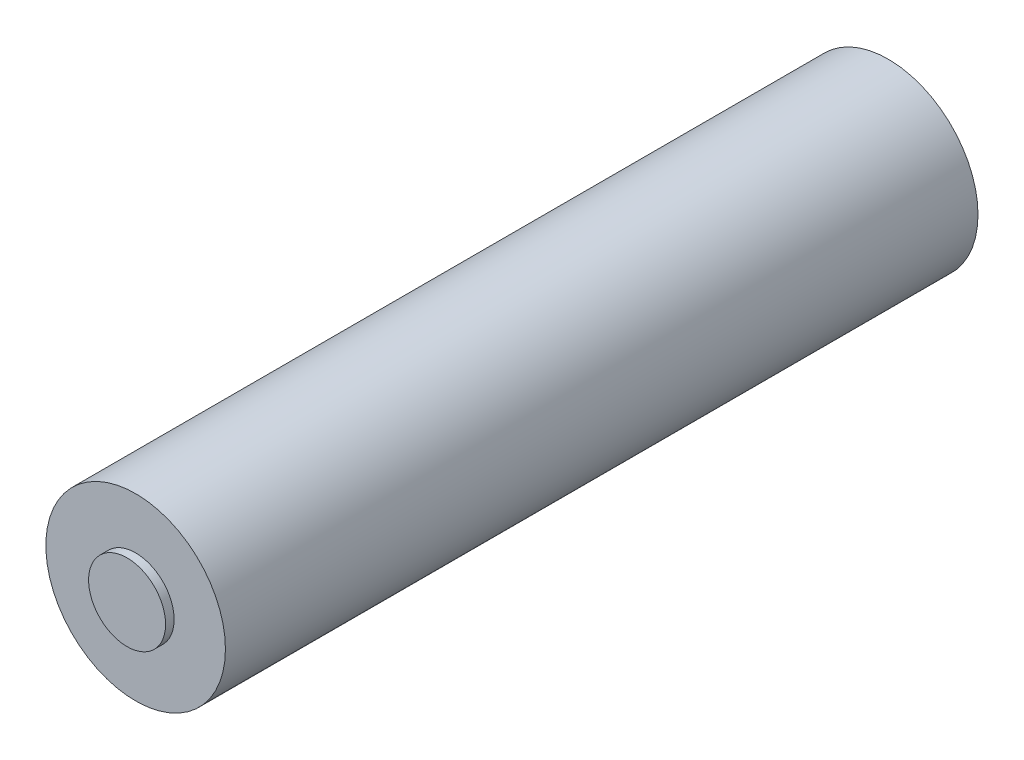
from build123d import *

# Parameters (mm, degrees)
ESQUISSE1_R      = 5.25
EXTRUSION1_DEPTH = 44
ESQUISSE2_R      = 2.25
EXTRUSION2_DEPTH = 0.5


with BuildPart() as part:
    # Esquisse1 → Extrusion1 (new body)
    with BuildSketch(Plane.XY):
        Circle(ESQUISSE1_R)
    extrude(amount=EXTRUSION1_DEPTH)

    # Esquisse2 → Extrusion2 (add)
    with BuildSketch(Plane.XY.offset(44)):
        Circle(ESQUISSE2_R)
    extrude(amount=EXTRUSION2_DEPTH)


solid = part.part
